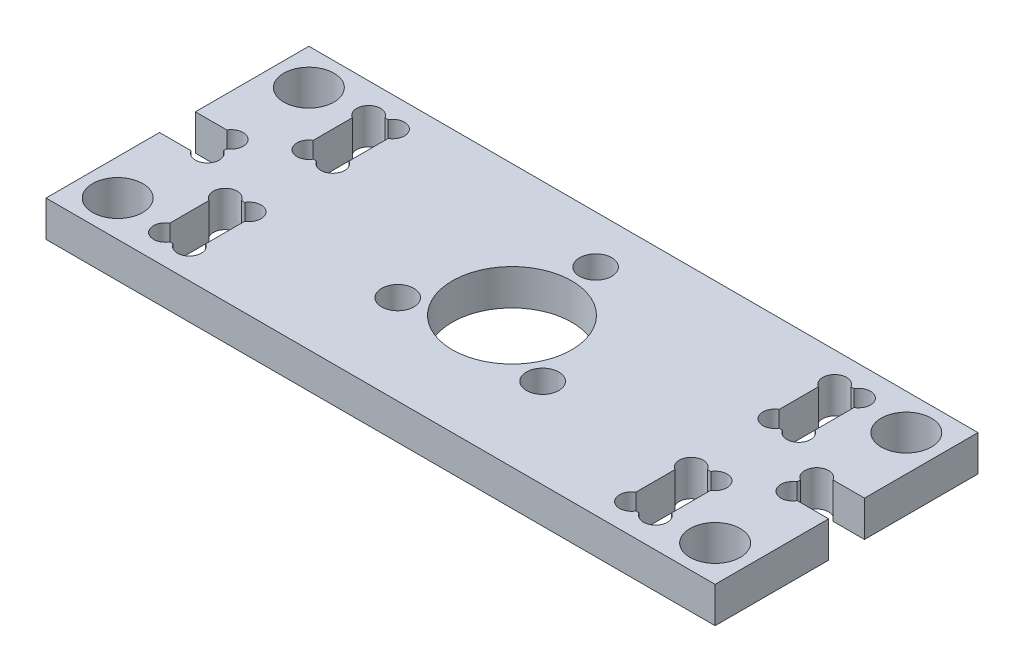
from build123d import *

# Parameters (mm, degrees)
SKETCH_1_W              = 56
SKETCH_1_H              = 22
EXTRUDE_1_DEPTH         = 3
HOLE_WIZARD_4_2_4_2_1_D = 4.2
SKETCH_4_R              = 5
CUT_EXTRUDE_1_DEPTH     = 31.232432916
SKETCH_5_W              = 3
SKETCH_5_H              = 6
SKETCH_5_W_2            = 4
SKETCH_5_H_2            = 3
CUT_EXTRUDE_2_DEPTH     = 31.232432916
HOLE_WIZARD_2_0_2_1_D   = 2
HOLE_WIZARD_2_7_2_7_1_D = 2.7


with BuildPart() as part:
    # Sketch 1 → Extrude 1 (new body)
    with BuildSketch(Plane(origin=(0, 0, 0), x_dir=(1, 0, 0), z_dir=(0, 1, 0))):
        Rectangle(SKETCH_1_W, SKETCH_1_H)
    extrude(amount=EXTRUDE_1_DEPTH)

    # Hole Wizard 4.2 _4.2_ _1 (through all)
    with Locations(Plane(origin=(0, 3, 0), x_dir=(1, 0, 0), z_dir=(0, 1, 0))):
        with Locations((-25, -8), (-25, 8), (25, 8), (25, -8)):
            Hole(HOLE_WIZARD_4_2_4_2_1_D / 2)

    # Sketch 4 → Cut-Extrude 1 (cut, through all)
    with BuildSketch(Plane(origin=(0, 3, 0), x_dir=(1, 0, 0), z_dir=(0, 1, 0))):
        with Locations(Location((0, 0, 0), (0, 0, 270))):
            Circle(SKETCH_4_R)
    extrude(amount=-CUT_EXTRUDE_1_DEPTH, mode=Mode.SUBTRACT)

    # Sketch 5 → Cut-Extrude 2 (cut, through all)
    with BuildSketch(Plane(origin=(0, 3, 0), x_dir=(1, 0, 0), z_dir=(0, 1, 0))):
        with Locations((-19.5, 6)):
            Rectangle(SKETCH_5_W, SKETCH_5_H)
        with Locations((-19.5, -6)):
            Rectangle(SKETCH_5_W, SKETCH_5_H)
        with Locations((19.5, -6)):
            Rectangle(SKETCH_5_W, SKETCH_5_H)
        with Locations((19.5, 6)):
            Rectangle(SKETCH_5_W, SKETCH_5_H)
        with Locations((26, 0)):
            Rectangle(SKETCH_5_W_2, SKETCH_5_H_2)
        with Locations((-26, 0)):
            Rectangle(SKETCH_5_W_2, SKETCH_5_H_2)
    extrude(amount=-CUT_EXTRUDE_2_DEPTH, mode=Mode.SUBTRACT)

    # Hole Wizard 2.0 _2_ _1 (through all)
    with Locations(Plane(origin=(0, 3, 0), x_dir=(1, 0, 0), z_dir=(0, 1, 0))):
        with Locations((-20.5, 8.5), (-18.5, 8.5), (-18.5, 3.5), (-20.5, 3.5), (-24.5, 1), (-24.5, -1), (-20.5, -3.5), (-18.5, -3.5), (-18.5, -8.5), (-20.5, -8.5), (20.5, -8.5), (18.5, -8.5), (18.5, -3.5), (20.5, -3.5), (24.5, -1), (24.5, 1), (20.5, 3.5), (18.5, 3.5), (18.5, 8.5), (20.5, 8.5)):
            Hole(HOLE_WIZARD_2_0_2_1_D / 2)

    # Hole Wizard 2.7 _2.7_ _1 (through all)
    with Locations(Plane(origin=(0, 3, 0), x_dir=(1, 0, 0), z_dir=(0, 1, 0))):
        with Locations((0, 0), (0, 7), (6.062177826, -3.5), (-6.062177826, -3.5)):
            Hole(HOLE_WIZARD_2_7_2_7_1_D / 2)


solid = part.part
